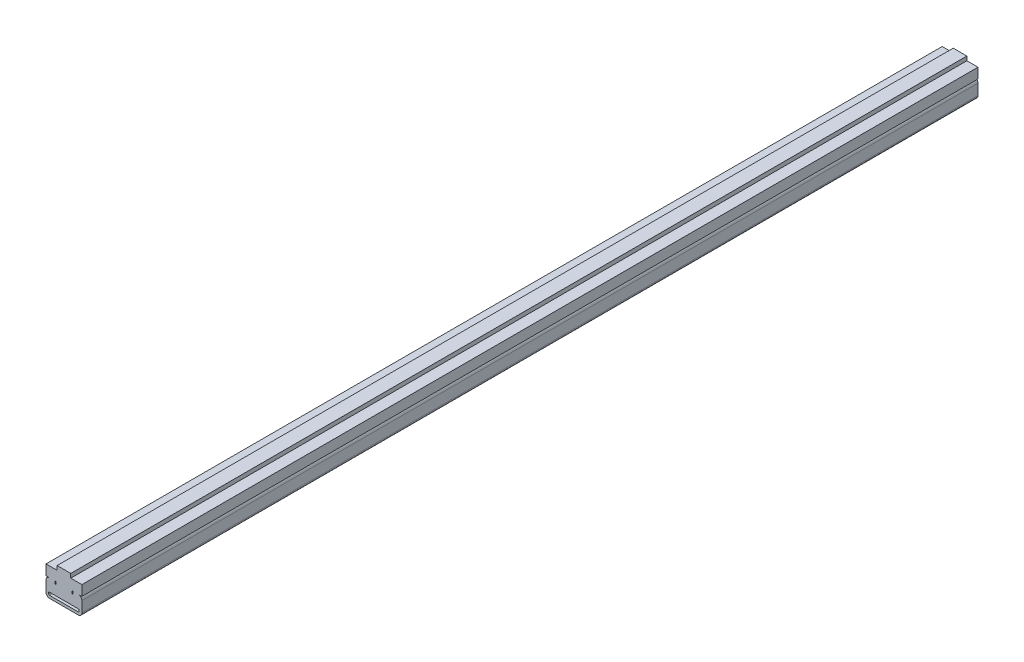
ISO-10303-21;
HEADER;
FILE_DESCRIPTION(('STEP AP214'),'2;1');
FILE_NAME('part.step','',(''),(''),'','','');
FILE_SCHEMA(('AUTOMOTIVE_DESIGN { 1 0 10303 214 1 1 1 1 }'));
ENDSEC;
DATA;
#1=APPLICATION_CONTEXT('core data for automotive mechanical design processes');
#2=APPLICATION_PROTOCOL_DEFINITION('international standard','automotive_design',2000,#1);
#3=PRODUCT_CONTEXT('',#1,'mechanical');
#4=PRODUCT('Part','Part','',(#3));
#5=PRODUCT_RELATED_PRODUCT_CATEGORY('part','',(#4));
#6=PRODUCT_DEFINITION_FORMATION('','',#4);
#7=PRODUCT_DEFINITION_CONTEXT('part definition',#1,'design');
#8=PRODUCT_DEFINITION('design','',#6,#7);
#9=PRODUCT_DEFINITION_SHAPE('','',#8);
#10=(LENGTH_UNIT() NAMED_UNIT(*) SI_UNIT(.MILLI.,.METRE.));
#11=(NAMED_UNIT(*) PLANE_ANGLE_UNIT() SI_UNIT($,.RADIAN.));
#12=(NAMED_UNIT(*) SI_UNIT($,.STERADIAN.) SOLID_ANGLE_UNIT());
#13=UNCERTAINTY_MEASURE_WITH_UNIT(LENGTH_MEASURE(1.E-05),#10,'distance_accuracy_value','');
#14=(GEOMETRIC_REPRESENTATION_CONTEXT(3) GLOBAL_UNCERTAINTY_ASSIGNED_CONTEXT((#13)) GLOBAL_UNIT_ASSIGNED_CONTEXT((#10,
#11,#12)) REPRESENTATION_CONTEXT('',''));
#15=CARTESIAN_POINT('',(0.,0.,0.));
#16=DIRECTION('',(0.,0.,1.));
#17=DIRECTION('',(1.,0.,0.));
#18=AXIS2_PLACEMENT_3D('',#15,#16,#17);
#19=CARTESIAN_POINT('',(8.,7.99999999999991,0.));
#20=DIRECTION('',(0.,0.,1.));
#21=DIRECTION('',(1.,0.,0.));
#22=AXIS2_PLACEMENT_3D('',#19,#20,#21);
#23=PLANE('',#22);
#24=DIRECTION('',(0.,-1.,0.));
#25=VECTOR('',#24,1.);
#26=CARTESIAN_POINT('',(-8.5,3.0000000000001,0.));
#27=LINE('',#26,#25);
#28=CARTESIAN_POINT('',(-8.5,3.0000000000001,0.));
#29=VERTEX_POINT('',#28);
#30=CARTESIAN_POINT('',(-8.5,1.9999999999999,0.));
#31=VERTEX_POINT('',#30);
#32=EDGE_CURVE('E224',#29,#31,#27,.T.);
#33=ORIENTED_EDGE('',*,*,#32,.T.);
#34=CARTESIAN_POINT('',(-8.,1.9999999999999,0.));
#35=DIRECTION('',(0.,0.,1.));
#36=DIRECTION('',(1.,0.,0.));
#37=AXIS2_PLACEMENT_3D('',#34,#35,#36);
#38=CIRCLE('',#37,0.5);
#39=CARTESIAN_POINT('',(-8.,1.4999999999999,0.));
#40=VERTEX_POINT('',#39);
#41=EDGE_CURVE('E219',#31,#40,#38,.T.);
#42=ORIENTED_EDGE('',*,*,#41,.T.);
#43=DIRECTION('',(-1.,0.,0.));
#44=VECTOR('',#43,1.);
#45=CARTESIAN_POINT('',(8.,1.5000000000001,0.));
#46=LINE('',#45,#44);
#47=CARTESIAN_POINT('',(8.,1.5000000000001,0.));
#48=VERTEX_POINT('',#47);
#49=EDGE_CURVE('E211',#48,#40,#46,.T.);
#50=ORIENTED_EDGE('',*,*,#49,.F.);
#51=CARTESIAN_POINT('',(8.,2.0000000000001,0.));
#52=DIRECTION('',(0.,0.,1.));
#53=DIRECTION('',(1.,0.,0.));
#54=AXIS2_PLACEMENT_3D('',#51,#52,#53);
#55=CIRCLE('',#54,0.5);
#56=CARTESIAN_POINT('',(8.5,2.0000000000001,0.));
#57=VERTEX_POINT('',#56);
#58=EDGE_CURVE('E29',#48,#57,#55,.T.);
#59=ORIENTED_EDGE('',*,*,#58,.T.);
#60=DIRECTION('',(0.,-1.,0.));
#61=VECTOR('',#60,1.);
#62=CARTESIAN_POINT('',(8.5,2.9999999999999,0.));
#63=LINE('',#62,#61);
#64=CARTESIAN_POINT('',(8.5,2.9999999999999,0.));
#65=VERTEX_POINT('',#64);
#66=EDGE_CURVE('E236',#65,#57,#63,.T.);
#67=ORIENTED_EDGE('',*,*,#66,.F.);
#68=DIRECTION('',(-1.,0.,0.));
#69=VECTOR('',#68,1.);
#70=CARTESIAN_POINT('',(8.5,2.9999999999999,0.));
#71=LINE('',#70,#69);
#72=EDGE_CURVE('E238',#65,#29,#71,.T.);
#73=ORIENTED_EDGE('',*,*,#72,.T.);
#74=EDGE_LOOP('',(#33,#42,#50,#59,#67,#73));
#75=FACE_BOUND('',#74,.T.);
#76=DIRECTION('',(-1.,0.,0.));
#77=VECTOR('',#76,1.);
#78=CARTESIAN_POINT('',(-8.,10.,0.));
#79=LINE('',#78,#77);
#80=CARTESIAN_POINT('',(-8.,10.,0.));
#81=VERTEX_POINT('',#80);
#82=CARTESIAN_POINT('',(-10.,10.,0.));
#83=VERTEX_POINT('',#82);
#84=EDGE_CURVE('E325',#81,#83,#79,.T.);
#85=ORIENTED_EDGE('',*,*,#84,.T.);
#86=DIRECTION('',(0.,-1.,0.));
#87=VECTOR('',#86,1.);
#88=CARTESIAN_POINT('',(-10.,15.7,0.));
#89=LINE('',#88,#87);
#90=CARTESIAN_POINT('',(-10.,15.7,0.));
#91=VERTEX_POINT('',#90);
#92=EDGE_CURVE('E327',#91,#83,#89,.T.);
#93=ORIENTED_EDGE('',*,*,#92,.F.);
#94=DIRECTION('',(-1.,0.,0.));
#95=VECTOR('',#94,1.);
#96=CARTESIAN_POINT('',(-3.79999999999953,15.7,0.));
#97=LINE('',#96,#95);
#98=CARTESIAN_POINT('',(-3.79999999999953,15.7,0.));
#99=VERTEX_POINT('',#98);
#100=EDGE_CURVE('E331',#99,#91,#97,.T.);
#101=ORIENTED_EDGE('',*,*,#100,.F.);
#102=DIRECTION('',(0.,-1.,0.));
#103=VECTOR('',#102,1.);
#104=CARTESIAN_POINT('',(-3.79999999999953,18.,0.));
#105=LINE('',#104,#103);
#106=CARTESIAN_POINT('',(-3.79999999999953,18.,0.));
#107=VERTEX_POINT('',#106);
#108=EDGE_CURVE('E334',#107,#99,#105,.T.);
#109=ORIENTED_EDGE('',*,*,#108,.F.);
#110=DIRECTION('',(-1.,0.,0.));
#111=VECTOR('',#110,1.);
#112=CARTESIAN_POINT('',(3.79999999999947,18.,0.));
#113=LINE('',#112,#111);
#114=CARTESIAN_POINT('',(3.79999999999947,18.,0.));
#115=VERTEX_POINT('',#114);
#116=EDGE_CURVE('E337',#115,#107,#113,.T.);
#117=ORIENTED_EDGE('',*,*,#116,.F.);
#118=DIRECTION('',(0.,-1.,0.));
#119=VECTOR('',#118,1.);
#120=CARTESIAN_POINT('',(3.79999999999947,18.,0.));
#121=LINE('',#120,#119);
#122=CARTESIAN_POINT('',(3.79999999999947,15.7,0.));
#123=VERTEX_POINT('',#122);
#124=EDGE_CURVE('E340',#115,#123,#121,.T.);
#125=ORIENTED_EDGE('',*,*,#124,.T.);
#126=DIRECTION('',(1.,0.,0.));
#127=VECTOR('',#126,1.);
#128=CARTESIAN_POINT('',(3.79999999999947,15.7,0.));
#129=LINE('',#128,#127);
#130=CARTESIAN_POINT('',(10.,15.7,0.));
#131=VERTEX_POINT('',#130);
#132=EDGE_CURVE('E342',#123,#131,#129,.T.);
#133=ORIENTED_EDGE('',*,*,#132,.T.);
#134=DIRECTION('',(0.,-1.,0.));
#135=VECTOR('',#134,1.);
#136=CARTESIAN_POINT('',(10.,15.7,0.));
#137=LINE('',#136,#135);
#138=CARTESIAN_POINT('',(10.,10.,0.));
#139=VERTEX_POINT('',#138);
#140=EDGE_CURVE('E344',#131,#139,#137,.T.);
#141=ORIENTED_EDGE('',*,*,#140,.T.);
#142=DIRECTION('',(-1.,0.,0.));
#143=VECTOR('',#142,1.);
#144=CARTESIAN_POINT('',(10.,10.,0.));
#145=LINE('',#144,#143);
#146=CARTESIAN_POINT('',(8.,10.,0.));
#147=VERTEX_POINT('',#146);
#148=EDGE_CURVE('E346',#139,#147,#145,.T.);
#149=ORIENTED_EDGE('',*,*,#148,.T.);
#150=CARTESIAN_POINT('',(8.,7.99999999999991,0.));
#151=DIRECTION('',(0.,0.,1.));
#152=DIRECTION('',(1.,0.,0.));
#153=AXIS2_PLACEMENT_3D('',#150,#151,#152);
#154=CIRCLE('',#153,2.);
#155=CARTESIAN_POINT('',(10.,7.99999999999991,0.));
#156=VERTEX_POINT('',#155);
#157=EDGE_CURVE('E348',#156,#147,#154,.T.);
#158=ORIENTED_EDGE('',*,*,#157,.F.);
#159=DIRECTION('',(0.,-1.,0.));
#160=VECTOR('',#159,1.);
#161=CARTESIAN_POINT('',(10.,7.99999999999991,0.));
#162=LINE('',#161,#160);
#163=CARTESIAN_POINT('',(10.,2.0000000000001,0.));
#164=VERTEX_POINT('',#163);
#165=EDGE_CURVE('E351',#156,#164,#162,.T.);
#166=ORIENTED_EDGE('',*,*,#165,.T.);
#167=CARTESIAN_POINT('',(8.,2.0000000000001,0.));
#168=DIRECTION('',(0.,0.,1.));
#169=DIRECTION('',(1.,0.,0.));
#170=AXIS2_PLACEMENT_3D('',#167,#168,#169);
#171=CIRCLE('',#170,2.);
#172=CARTESIAN_POINT('',(8.,0.,0.));
#173=VERTEX_POINT('',#172);
#174=EDGE_CURVE('E353',#173,#164,#171,.T.);
#175=ORIENTED_EDGE('',*,*,#174,.F.);
#176=DIRECTION('',(-1.,0.,0.));
#177=VECTOR('',#176,1.);
#178=CARTESIAN_POINT('',(8.,0.,0.));
#179=LINE('',#178,#177);
#180=CARTESIAN_POINT('',(-8.,0.,0.));
#181=VERTEX_POINT('',#180);
#182=EDGE_CURVE('E356',#173,#181,#179,.T.);
#183=ORIENTED_EDGE('',*,*,#182,.T.);
#184=CARTESIAN_POINT('',(-8.,1.9999999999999,0.));
#185=DIRECTION('',(0.,0.,1.));
#186=DIRECTION('',(1.,0.,0.));
#187=AXIS2_PLACEMENT_3D('',#184,#185,#186);
#188=CIRCLE('',#187,2.);
#189=CARTESIAN_POINT('',(-10.,1.9999999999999,0.));
#190=VERTEX_POINT('',#189);
#191=EDGE_CURVE('E358',#190,#181,#188,.T.);
#192=ORIENTED_EDGE('',*,*,#191,.F.);
#193=DIRECTION('',(0.,-1.,0.));
#194=VECTOR('',#193,1.);
#195=CARTESIAN_POINT('',(-10.,7.99999999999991,0.));
#196=LINE('',#195,#194);
#197=CARTESIAN_POINT('',(-10.,7.99999999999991,0.));
#198=VERTEX_POINT('',#197);
#199=EDGE_CURVE('E361',#198,#190,#196,.T.);
#200=ORIENTED_EDGE('',*,*,#199,.F.);
#201=CARTESIAN_POINT('',(-8.,7.99999999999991,0.));
#202=DIRECTION('',(0.,0.,1.));
#203=DIRECTION('',(1.,0.,0.));
#204=AXIS2_PLACEMENT_3D('',#201,#202,#203);
#205=CIRCLE('',#204,2.);
#206=EDGE_CURVE('E364',#81,#198,#205,.T.);
#207=ORIENTED_EDGE('',*,*,#206,.F.);
#208=EDGE_LOOP('',(#85,#93,#101,#109,#117,#125,#133,#141,#149,#158,#166,#175,#183,#192,#200,#207));
#209=FACE_BOUND('',#208,.T.);
#210=DIRECTION('',(-1.,0.,0.));
#211=VECTOR('',#210,1.);
#212=CARTESIAN_POINT('',(-4.5,8.49999999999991,0.));
#213=LINE('',#212,#211);
#214=CARTESIAN_POINT('',(-4.5,8.49999999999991,0.));
#215=VERTEX_POINT('',#214);
#216=CARTESIAN_POINT('',(-5.,8.50000000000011,0.));
#217=VERTEX_POINT('',#216);
#218=EDGE_CURVE('E304',#215,#217,#213,.T.);
#219=ORIENTED_EDGE('',*,*,#218,.F.);
#220=DIRECTION('',(0.,1.,0.));
#221=VECTOR('',#220,1.);
#222=CARTESIAN_POINT('',(-4.5,8.49999999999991,0.));
#223=LINE('',#222,#221);
#224=CARTESIAN_POINT('',(-4.5,10.,0.));
#225=VERTEX_POINT('',#224);
#226=EDGE_CURVE('E294',#215,#225,#223,.T.);
#227=ORIENTED_EDGE('',*,*,#226,.T.);
#228=DIRECTION('',(-1.,0.,0.));
#229=VECTOR('',#228,1.);
#230=CARTESIAN_POINT('',(-4.5,10.,0.));
#231=LINE('',#230,#229);
#232=CARTESIAN_POINT('',(-5.,10.,0.));
#233=VERTEX_POINT('',#232);
#234=EDGE_CURVE('E297',#225,#233,#231,.T.);
#235=ORIENTED_EDGE('',*,*,#234,.T.);
#236=DIRECTION('',(0.,1.,0.));
#237=VECTOR('',#236,1.);
#238=CARTESIAN_POINT('',(-5.,8.50000000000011,0.));
#239=LINE('',#238,#237);
#240=EDGE_CURVE('E301',#217,#233,#239,.T.);
#241=ORIENTED_EDGE('',*,*,#240,.F.);
#242=EDGE_LOOP('',(#219,#227,#235,#241));
#243=FACE_BOUND('',#242,.T.);
#244=DIRECTION('',(-1.,0.,0.));
#245=VECTOR('',#244,1.);
#246=CARTESIAN_POINT('',(5.,8.50000000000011,0.));
#247=LINE('',#246,#245);
#248=CARTESIAN_POINT('',(5.,8.50000000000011,0.));
#249=VERTEX_POINT('',#248);
#250=CARTESIAN_POINT('',(4.5,8.50000000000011,0.));
#251=VERTEX_POINT('',#250);
#252=EDGE_CURVE('E262',#249,#251,#247,.T.);
#253=ORIENTED_EDGE('',*,*,#252,.F.);
#254=DIRECTION('',(0.,1.,0.));
#255=VECTOR('',#254,1.);
#256=CARTESIAN_POINT('',(5.,8.50000000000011,0.));
#257=LINE('',#256,#255);
#258=CARTESIAN_POINT('',(5.,10.,0.));
#259=VERTEX_POINT('',#258);
#260=EDGE_CURVE('E270',#249,#259,#257,.T.);
#261=ORIENTED_EDGE('',*,*,#260,.T.);
#262=DIRECTION('',(-1.,0.,0.));
#263=VECTOR('',#262,1.);
#264=CARTESIAN_POINT('',(5.,10.,0.));
#265=LINE('',#264,#263);
#266=CARTESIAN_POINT('',(4.5,10.,0.));
#267=VERTEX_POINT('',#266);
#268=EDGE_CURVE('E267',#259,#267,#265,.T.);
#269=ORIENTED_EDGE('',*,*,#268,.T.);
#270=DIRECTION('',(0.,1.,0.));
#271=VECTOR('',#270,1.);
#272=CARTESIAN_POINT('',(4.5,8.50000000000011,0.));
#273=LINE('',#272,#271);
#274=EDGE_CURVE('E264',#251,#267,#273,.T.);
#275=ORIENTED_EDGE('',*,*,#274,.F.);
#276=EDGE_LOOP('',(#253,#261,#269,#275));
#277=FACE_BOUND('',#276,.T.);
#278=ADVANCED_FACE('F14',(#75,#209,#243,#277),#23,.F.);
#279=CARTESIAN_POINT('',(8.,7.99999999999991,500.));
#280=DIRECTION('',(0.,0.,1.));
#281=DIRECTION('',(1.,0.,0.));
#282=AXIS2_PLACEMENT_3D('',#279,#280,#281);
#283=PLANE('',#282);
#284=CARTESIAN_POINT('',(-8.,1.9999999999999,500.));
#285=DIRECTION('',(0.,0.,1.));
#286=DIRECTION('',(1.,0.,0.));
#287=AXIS2_PLACEMENT_3D('',#284,#285,#286);
#288=CIRCLE('',#287,0.5);
#289=CARTESIAN_POINT('',(-8.5,1.9999999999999,500.));
#290=VERTEX_POINT('',#289);
#291=CARTESIAN_POINT('',(-8.,1.4999999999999,500.));
#292=VERTEX_POINT('',#291);
#293=EDGE_CURVE('E37',#290,#292,#288,.T.);
#294=ORIENTED_EDGE('',*,*,#293,.F.);
#295=DIRECTION('',(0.,-1.,0.));
#296=VECTOR('',#295,1.);
#297=CARTESIAN_POINT('',(-8.5,3.0000000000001,500.));
#298=LINE('',#297,#296);
#299=CARTESIAN_POINT('',(-8.5,3.0000000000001,500.));
#300=VERTEX_POINT('',#299);
#301=EDGE_CURVE('E229',#300,#290,#298,.T.);
#302=ORIENTED_EDGE('',*,*,#301,.F.);
#303=DIRECTION('',(-1.,0.,0.));
#304=VECTOR('',#303,1.);
#305=CARTESIAN_POINT('',(8.5,2.9999999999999,500.));
#306=LINE('',#305,#304);
#307=CARTESIAN_POINT('',(8.5,2.9999999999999,500.));
#308=VERTEX_POINT('',#307);
#309=EDGE_CURVE('E232',#308,#300,#306,.T.);
#310=ORIENTED_EDGE('',*,*,#309,.F.);
#311=DIRECTION('',(0.,-1.,0.));
#312=VECTOR('',#311,1.);
#313=CARTESIAN_POINT('',(8.5,2.9999999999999,500.));
#314=LINE('',#313,#312);
#315=CARTESIAN_POINT('',(8.5,2.0000000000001,500.));
#316=VERTEX_POINT('',#315);
#317=EDGE_CURVE('E247',#308,#316,#314,.T.);
#318=ORIENTED_EDGE('',*,*,#317,.T.);
#319=CARTESIAN_POINT('',(8.,2.0000000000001,500.));
#320=DIRECTION('',(0.,0.,1.));
#321=DIRECTION('',(1.,0.,0.));
#322=AXIS2_PLACEMENT_3D('',#319,#320,#321);
#323=CIRCLE('',#322,0.5);
#324=CARTESIAN_POINT('',(8.,1.5000000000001,500.));
#325=VERTEX_POINT('',#324);
#326=EDGE_CURVE('E244',#325,#316,#323,.T.);
#327=ORIENTED_EDGE('',*,*,#326,.F.);
#328=DIRECTION('',(-1.,0.,0.));
#329=VECTOR('',#328,1.);
#330=CARTESIAN_POINT('',(8.,1.5000000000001,500.));
#331=LINE('',#330,#329);
#332=EDGE_CURVE('E242',#325,#292,#331,.T.);
#333=ORIENTED_EDGE('',*,*,#332,.T.);
#334=EDGE_LOOP('',(#294,#302,#310,#318,#327,#333));
#335=FACE_BOUND('',#334,.T.);
#336=DIRECTION('',(-1.,0.,0.));
#337=VECTOR('',#336,1.);
#338=CARTESIAN_POINT('',(-8.,10.,500.));
#339=LINE('',#338,#337);
#340=CARTESIAN_POINT('',(-8.,10.,500.));
#341=VERTEX_POINT('',#340);
#342=CARTESIAN_POINT('',(-10.,10.,500.));
#343=VERTEX_POINT('',#342);
#344=EDGE_CURVE('E318',#341,#343,#339,.T.);
#345=ORIENTED_EDGE('',*,*,#344,.F.);
#346=CARTESIAN_POINT('',(-8.,7.99999999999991,500.));
#347=DIRECTION('',(0.,0.,1.));
#348=DIRECTION('',(1.,0.,0.));
#349=AXIS2_PLACEMENT_3D('',#346,#347,#348);
#350=CIRCLE('',#349,2.);
#351=CARTESIAN_POINT('',(-10.,7.99999999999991,500.));
#352=VERTEX_POINT('',#351);
#353=EDGE_CURVE('E328',#341,#352,#350,.T.);
#354=ORIENTED_EDGE('',*,*,#353,.T.);
#355=DIRECTION('',(0.,-1.,0.));
#356=VECTOR('',#355,1.);
#357=CARTESIAN_POINT('',(-10.,7.99999999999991,500.));
#358=LINE('',#357,#356);
#359=CARTESIAN_POINT('',(-10.,1.9999999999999,500.));
#360=VERTEX_POINT('',#359);
#361=EDGE_CURVE('E406',#352,#360,#358,.T.);
#362=ORIENTED_EDGE('',*,*,#361,.T.);
#363=CARTESIAN_POINT('',(-8.,1.9999999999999,500.));
#364=DIRECTION('',(0.,0.,1.));
#365=DIRECTION('',(1.,0.,0.));
#366=AXIS2_PLACEMENT_3D('',#363,#364,#365);
#367=CIRCLE('',#366,2.);
#368=CARTESIAN_POINT('',(-8.,0.,500.));
#369=VERTEX_POINT('',#368);
#370=EDGE_CURVE('E403',#360,#369,#367,.T.);
#371=ORIENTED_EDGE('',*,*,#370,.T.);
#372=DIRECTION('',(-1.,0.,0.));
#373=VECTOR('',#372,1.);
#374=CARTESIAN_POINT('',(8.,0.,500.));
#375=LINE('',#374,#373);
#376=CARTESIAN_POINT('',(8.,0.,500.));
#377=VERTEX_POINT('',#376);
#378=EDGE_CURVE('E400',#377,#369,#375,.T.);
#379=ORIENTED_EDGE('',*,*,#378,.F.);
#380=CARTESIAN_POINT('',(8.,2.0000000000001,500.));
#381=DIRECTION('',(0.,0.,1.));
#382=DIRECTION('',(1.,0.,0.));
#383=AXIS2_PLACEMENT_3D('',#380,#381,#382);
#384=CIRCLE('',#383,2.);
#385=CARTESIAN_POINT('',(10.,2.0000000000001,500.));
#386=VERTEX_POINT('',#385);
#387=EDGE_CURVE('E397',#377,#386,#384,.T.);
#388=ORIENTED_EDGE('',*,*,#387,.T.);
#389=DIRECTION('',(0.,-1.,0.));
#390=VECTOR('',#389,1.);
#391=CARTESIAN_POINT('',(10.,7.99999999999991,500.));
#392=LINE('',#391,#390);
#393=CARTESIAN_POINT('',(10.,7.99999999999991,500.));
#394=VERTEX_POINT('',#393);
#395=EDGE_CURVE('E394',#394,#386,#392,.T.);
#396=ORIENTED_EDGE('',*,*,#395,.F.);
#397=CARTESIAN_POINT('',(8.,7.99999999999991,500.));
#398=DIRECTION('',(0.,0.,1.));
#399=DIRECTION('',(1.,0.,0.));
#400=AXIS2_PLACEMENT_3D('',#397,#398,#399);
#401=CIRCLE('',#400,2.);
#402=CARTESIAN_POINT('',(8.,10.,500.));
#403=VERTEX_POINT('',#402);
#404=EDGE_CURVE('E391',#394,#403,#401,.T.);
#405=ORIENTED_EDGE('',*,*,#404,.T.);
#406=DIRECTION('',(-1.,0.,0.));
#407=VECTOR('',#406,1.);
#408=CARTESIAN_POINT('',(10.,10.,500.));
#409=LINE('',#408,#407);
#410=CARTESIAN_POINT('',(10.,10.,500.));
#411=VERTEX_POINT('',#410);
#412=EDGE_CURVE('E388',#411,#403,#409,.T.);
#413=ORIENTED_EDGE('',*,*,#412,.F.);
#414=DIRECTION('',(0.,-1.,0.));
#415=VECTOR('',#414,1.);
#416=CARTESIAN_POINT('',(10.,15.7,500.));
#417=LINE('',#416,#415);
#418=CARTESIAN_POINT('',(10.,15.7,500.));
#419=VERTEX_POINT('',#418);
#420=EDGE_CURVE('E386',#419,#411,#417,.T.);
#421=ORIENTED_EDGE('',*,*,#420,.F.);
#422=DIRECTION('',(1.,0.,0.));
#423=VECTOR('',#422,1.);
#424=CARTESIAN_POINT('',(3.79999999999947,15.7,500.));
#425=LINE('',#424,#423);
#426=CARTESIAN_POINT('',(3.79999999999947,15.7,500.));
#427=VERTEX_POINT('',#426);
#428=EDGE_CURVE('E384',#427,#419,#425,.T.);
#429=ORIENTED_EDGE('',*,*,#428,.F.);
#430=DIRECTION('',(0.,-1.,0.));
#431=VECTOR('',#430,1.);
#432=CARTESIAN_POINT('',(3.79999999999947,18.,500.));
#433=LINE('',#432,#431);
#434=CARTESIAN_POINT('',(3.79999999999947,18.,500.));
#435=VERTEX_POINT('',#434);
#436=EDGE_CURVE('E382',#435,#427,#433,.T.);
#437=ORIENTED_EDGE('',*,*,#436,.F.);
#438=DIRECTION('',(-1.,0.,0.));
#439=VECTOR('',#438,1.);
#440=CARTESIAN_POINT('',(3.79999999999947,18.,500.));
#441=LINE('',#440,#439);
#442=CARTESIAN_POINT('',(-3.79999999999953,18.,500.));
#443=VERTEX_POINT('',#442);
#444=EDGE_CURVE('E379',#435,#443,#441,.T.);
#445=ORIENTED_EDGE('',*,*,#444,.T.);
#446=DIRECTION('',(0.,-1.,0.));
#447=VECTOR('',#446,1.);
#448=CARTESIAN_POINT('',(-3.79999999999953,18.,500.));
#449=LINE('',#448,#447);
#450=CARTESIAN_POINT('',(-3.79999999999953,15.7,500.));
#451=VERTEX_POINT('',#450);
#452=EDGE_CURVE('E376',#443,#451,#449,.T.);
#453=ORIENTED_EDGE('',*,*,#452,.T.);
#454=DIRECTION('',(-1.,0.,0.));
#455=VECTOR('',#454,1.);
#456=CARTESIAN_POINT('',(-3.79999999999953,15.7,500.));
#457=LINE('',#456,#455);
#458=CARTESIAN_POINT('',(-10.,15.7,500.));
#459=VERTEX_POINT('',#458);
#460=EDGE_CURVE('E373',#451,#459,#457,.T.);
#461=ORIENTED_EDGE('',*,*,#460,.T.);
#462=DIRECTION('',(0.,-1.,0.));
#463=VECTOR('',#462,1.);
#464=CARTESIAN_POINT('',(-10.,15.7,500.));
#465=LINE('',#464,#463);
#466=EDGE_CURVE('E370',#459,#343,#465,.T.);
#467=ORIENTED_EDGE('',*,*,#466,.T.);
#468=EDGE_LOOP('',(#345,#354,#362,#371,#379,#388,#396,#405,#413,#421,#429,#437,#445,#453,#461,#467));
#469=FACE_BOUND('',#468,.T.);
#470=DIRECTION('',(0.,1.,0.));
#471=VECTOR('',#470,1.);
#472=CARTESIAN_POINT('',(-4.5,8.49999999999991,500.));
#473=LINE('',#472,#471);
#474=CARTESIAN_POINT('',(-4.5,8.49999999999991,500.));
#475=VERTEX_POINT('',#474);
#476=CARTESIAN_POINT('',(-4.5,10.,500.));
#477=VERTEX_POINT('',#476);
#478=EDGE_CURVE('E293',#475,#477,#473,.T.);
#479=ORIENTED_EDGE('',*,*,#478,.F.);
#480=DIRECTION('',(-1.,0.,0.));
#481=VECTOR('',#480,1.);
#482=CARTESIAN_POINT('',(-4.5,8.49999999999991,500.));
#483=LINE('',#482,#481);
#484=CARTESIAN_POINT('',(-5.,8.50000000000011,500.));
#485=VERTEX_POINT('',#484);
#486=EDGE_CURVE('E298',#475,#485,#483,.T.);
#487=ORIENTED_EDGE('',*,*,#486,.T.);
#488=DIRECTION('',(0.,1.,0.));
#489=VECTOR('',#488,1.);
#490=CARTESIAN_POINT('',(-5.,8.50000000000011,500.));
#491=LINE('',#490,#489);
#492=CARTESIAN_POINT('',(-5.,10.,500.));
#493=VERTEX_POINT('',#492);
#494=EDGE_CURVE('E311',#485,#493,#491,.T.);
#495=ORIENTED_EDGE('',*,*,#494,.T.);
#496=DIRECTION('',(-1.,0.,0.));
#497=VECTOR('',#496,1.);
#498=CARTESIAN_POINT('',(-4.5,10.,500.));
#499=LINE('',#498,#497);
#500=EDGE_CURVE('E308',#477,#493,#499,.T.);
#501=ORIENTED_EDGE('',*,*,#500,.F.);
#502=EDGE_LOOP('',(#479,#487,#495,#501));
#503=FACE_BOUND('',#502,.T.);
#504=DIRECTION('',(0.,1.,0.));
#505=VECTOR('',#504,1.);
#506=CARTESIAN_POINT('',(5.,8.50000000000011,500.));
#507=LINE('',#506,#505);
#508=CARTESIAN_POINT('',(5.,8.50000000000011,500.));
#509=VERTEX_POINT('',#508);
#510=CARTESIAN_POINT('',(5.,10.,500.));
#511=VERTEX_POINT('',#510);
#512=EDGE_CURVE('E265',#509,#511,#507,.T.);
#513=ORIENTED_EDGE('',*,*,#512,.F.);
#514=DIRECTION('',(-1.,0.,0.));
#515=VECTOR('',#514,1.);
#516=CARTESIAN_POINT('',(5.,8.50000000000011,500.));
#517=LINE('',#516,#515);
#518=CARTESIAN_POINT('',(4.5,8.50000000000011,500.));
#519=VERTEX_POINT('',#518);
#520=EDGE_CURVE('E254',#509,#519,#517,.T.);
#521=ORIENTED_EDGE('',*,*,#520,.T.);
#522=DIRECTION('',(0.,1.,0.));
#523=VECTOR('',#522,1.);
#524=CARTESIAN_POINT('',(4.5,8.50000000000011,500.));
#525=LINE('',#524,#523);
#526=CARTESIAN_POINT('',(4.5,10.,500.));
#527=VERTEX_POINT('',#526);
#528=EDGE_CURVE('E276',#519,#527,#525,.T.);
#529=ORIENTED_EDGE('',*,*,#528,.T.);
#530=DIRECTION('',(-1.,0.,0.));
#531=VECTOR('',#530,1.);
#532=CARTESIAN_POINT('',(5.,10.,500.));
#533=LINE('',#532,#531);
#534=EDGE_CURVE('E279',#511,#527,#533,.T.);
#535=ORIENTED_EDGE('',*,*,#534,.F.);
#536=EDGE_LOOP('',(#513,#521,#529,#535));
#537=FACE_BOUND('',#536,.T.);
#538=ADVANCED_FACE('F451',(#335,#469,#503,#537),#283,.T.);
#539=CARTESIAN_POINT('',(-8.,10.,0.));
#540=DIRECTION('',(0.,1.,0.));
#541=DIRECTION('',(-1.,0.,0.));
#542=AXIS2_PLACEMENT_3D('',#539,#540,#541);
#543=PLANE('',#542);
#544=ORIENTED_EDGE('',*,*,#344,.T.);
#545=DIRECTION('',(0.,0.,1.));
#546=VECTOR('',#545,1.);
#547=CARTESIAN_POINT('',(-10.,10.,0.));
#548=LINE('',#547,#546);
#549=EDGE_CURVE('E9',#83,#343,#548,.T.);
#550=ORIENTED_EDGE('',*,*,#549,.F.);
#551=ORIENTED_EDGE('',*,*,#84,.F.);
#552=DIRECTION('',(0.,0.,1.));
#553=VECTOR('',#552,1.);
#554=CARTESIAN_POINT('',(-8.,10.,0.));
#555=LINE('',#554,#553);
#556=EDGE_CURVE('E367',#81,#341,#555,.T.);
#557=ORIENTED_EDGE('',*,*,#556,.T.);
#558=EDGE_LOOP('',(#544,#550,#551,#557));
#559=FACE_BOUND('',#558,.T.);
#560=ADVANCED_FACE('F16',(#559),#543,.F.);
#561=CARTESIAN_POINT('',(-10.,15.7,0.));
#562=DIRECTION('',(-1.,0.,0.));
#563=DIRECTION('',(0.,-1.,0.));
#564=AXIS2_PLACEMENT_3D('',#561,#562,#563);
#565=PLANE('',#564);
#566=ORIENTED_EDGE('',*,*,#466,.F.);
#567=DIRECTION('',(0.,0.,1.));
#568=VECTOR('',#567,1.);
#569=CARTESIAN_POINT('',(-10.,15.7,0.));
#570=LINE('',#569,#568);
#571=EDGE_CURVE('E22',#91,#459,#570,.T.);
#572=ORIENTED_EDGE('',*,*,#571,.F.);
#573=ORIENTED_EDGE('',*,*,#92,.T.);
#574=ORIENTED_EDGE('',*,*,#549,.T.);
#575=EDGE_LOOP('',(#566,#572,#573,#574));
#576=FACE_BOUND('',#575,.T.);
#577=ADVANCED_FACE('F447',(#576),#565,.T.);
#578=CARTESIAN_POINT('',(-3.79999999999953,15.7,0.));
#579=DIRECTION('',(0.,1.,0.));
#580=DIRECTION('',(0.,0.,1.));
#581=AXIS2_PLACEMENT_3D('',#578,#579,#580);
#582=PLANE('',#581);
#583=ORIENTED_EDGE('',*,*,#460,.F.);
#584=DIRECTION('',(0.,0.,1.));
#585=VECTOR('',#584,1.);
#586=CARTESIAN_POINT('',(-3.79999999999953,15.7,0.));
#587=LINE('',#586,#585);
#588=EDGE_CURVE('E439',#99,#451,#587,.T.);
#589=ORIENTED_EDGE('',*,*,#588,.F.);
#590=ORIENTED_EDGE('',*,*,#100,.T.);
#591=ORIENTED_EDGE('',*,*,#571,.T.);
#592=EDGE_LOOP('',(#583,#589,#590,#591));
#593=FACE_BOUND('',#592,.T.);
#594=ADVANCED_FACE('F443',(#593),#582,.T.);
#595=CARTESIAN_POINT('',(-3.79999999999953,18.,0.));
#596=DIRECTION('',(-1.,0.,0.));
#597=DIRECTION('',(0.,-1.,0.));
#598=AXIS2_PLACEMENT_3D('',#595,#596,#597);
#599=PLANE('',#598);
#600=ORIENTED_EDGE('',*,*,#452,.F.);
#601=DIRECTION('',(0.,0.,1.));
#602=VECTOR('',#601,1.);
#603=CARTESIAN_POINT('',(-3.79999999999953,18.,0.));
#604=LINE('',#603,#602);
#605=EDGE_CURVE('E437',#107,#443,#604,.T.);
#606=ORIENTED_EDGE('',*,*,#605,.F.);
#607=ORIENTED_EDGE('',*,*,#108,.T.);
#608=ORIENTED_EDGE('',*,*,#588,.T.);
#609=EDGE_LOOP('',(#600,#606,#607,#608));
#610=FACE_BOUND('',#609,.T.);
#611=ADVANCED_FACE('F457',(#610),#599,.T.);
#612=CARTESIAN_POINT('',(3.79999999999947,18.,0.));
#613=DIRECTION('',(0.,1.,0.));
#614=DIRECTION('',(0.,0.,1.));
#615=AXIS2_PLACEMENT_3D('',#612,#613,#614);
#616=PLANE('',#615);
#617=ORIENTED_EDGE('',*,*,#444,.F.);
#618=DIRECTION('',(0.,0.,1.));
#619=VECTOR('',#618,1.);
#620=CARTESIAN_POINT('',(3.79999999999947,18.,0.));
#621=LINE('',#620,#619);
#622=EDGE_CURVE('E435',#115,#435,#621,.T.);
#623=ORIENTED_EDGE('',*,*,#622,.F.);
#624=ORIENTED_EDGE('',*,*,#116,.T.);
#625=ORIENTED_EDGE('',*,*,#605,.T.);
#626=EDGE_LOOP('',(#617,#623,#624,#625));
#627=FACE_BOUND('',#626,.T.);
#628=ADVANCED_FACE('F512',(#627),#616,.T.);
#629=CARTESIAN_POINT('',(3.79999999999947,18.,0.));
#630=DIRECTION('',(-1.,0.,0.));
#631=DIRECTION('',(0.,-1.,0.));
#632=AXIS2_PLACEMENT_3D('',#629,#630,#631);
#633=PLANE('',#632);
#634=ORIENTED_EDGE('',*,*,#436,.T.);
#635=DIRECTION('',(0.,0.,1.));
#636=VECTOR('',#635,1.);
#637=CARTESIAN_POINT('',(3.79999999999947,15.7,0.));
#638=LINE('',#637,#636);
#639=EDGE_CURVE('E432',#123,#427,#638,.T.);
#640=ORIENTED_EDGE('',*,*,#639,.F.);
#641=ORIENTED_EDGE('',*,*,#124,.F.);
#642=ORIENTED_EDGE('',*,*,#622,.T.);
#643=EDGE_LOOP('',(#634,#640,#641,#642));
#644=FACE_BOUND('',#643,.T.);
#645=ADVANCED_FACE('F510',(#644),#633,.F.);
#646=CARTESIAN_POINT('',(3.79999999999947,15.7,0.));
#647=DIRECTION('',(0.,-1.,0.));
#648=DIRECTION('',(0.,0.,-1.));
#649=AXIS2_PLACEMENT_3D('',#646,#647,#648);
#650=PLANE('',#649);
#651=ORIENTED_EDGE('',*,*,#428,.T.);
#652=DIRECTION('',(0.,0.,1.));
#653=VECTOR('',#652,1.);
#654=CARTESIAN_POINT('',(10.,15.7,0.));
#655=LINE('',#654,#653);
#656=EDGE_CURVE('E429',#131,#419,#655,.T.);
#657=ORIENTED_EDGE('',*,*,#656,.F.);
#658=ORIENTED_EDGE('',*,*,#132,.F.);
#659=ORIENTED_EDGE('',*,*,#639,.T.);
#660=EDGE_LOOP('',(#651,#657,#658,#659));
#661=FACE_BOUND('',#660,.T.);
#662=ADVANCED_FACE('F506',(#661),#650,.F.);
#663=CARTESIAN_POINT('',(10.,15.7,0.));
#664=DIRECTION('',(-1.,0.,0.));
#665=DIRECTION('',(0.,0.,1.));
#666=AXIS2_PLACEMENT_3D('',#663,#664,#665);
#667=PLANE('',#666);
#668=ORIENTED_EDGE('',*,*,#420,.T.);
#669=DIRECTION('',(0.,0.,1.));
#670=VECTOR('',#669,1.);
#671=CARTESIAN_POINT('',(10.,10.,0.));
#672=LINE('',#671,#670);
#673=EDGE_CURVE('E426',#139,#411,#672,.T.);
#674=ORIENTED_EDGE('',*,*,#673,.F.);
#675=ORIENTED_EDGE('',*,*,#140,.F.);
#676=ORIENTED_EDGE('',*,*,#656,.T.);
#677=EDGE_LOOP('',(#668,#674,#675,#676));
#678=FACE_BOUND('',#677,.T.);
#679=ADVANCED_FACE('F501',(#678),#667,.F.);
#680=CARTESIAN_POINT('',(10.,10.,0.));
#681=DIRECTION('',(0.,1.,0.));
#682=DIRECTION('',(-1.,0.,0.));
#683=AXIS2_PLACEMENT_3D('',#680,#681,#682);
#684=PLANE('',#683);
#685=ORIENTED_EDGE('',*,*,#412,.T.);
#686=DIRECTION('',(0.,0.,1.));
#687=VECTOR('',#686,1.);
#688=CARTESIAN_POINT('',(8.,10.,0.));
#689=LINE('',#688,#687);
#690=EDGE_CURVE('E424',#147,#403,#689,.T.);
#691=ORIENTED_EDGE('',*,*,#690,.F.);
#692=ORIENTED_EDGE('',*,*,#148,.F.);
#693=ORIENTED_EDGE('',*,*,#673,.T.);
#694=EDGE_LOOP('',(#685,#691,#692,#693));
#695=FACE_BOUND('',#694,.T.);
#696=ADVANCED_FACE('F496',(#695),#684,.F.);
#697=CARTESIAN_POINT('',(8.,7.99999999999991,0.));
#698=DIRECTION('',(0.,0.,1.));
#699=DIRECTION('',(1.,0.,0.));
#700=AXIS2_PLACEMENT_3D('',#697,#698,#699);
#701=CYLINDRICAL_SURFACE('',#700,2.);
#702=ORIENTED_EDGE('',*,*,#404,.F.);
#703=DIRECTION('',(0.,0.,1.));
#704=VECTOR('',#703,1.);
#705=CARTESIAN_POINT('',(10.,7.99999999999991,0.));
#706=LINE('',#705,#704);
#707=EDGE_CURVE('E422',#156,#394,#706,.T.);
#708=ORIENTED_EDGE('',*,*,#707,.F.);
#709=ORIENTED_EDGE('',*,*,#157,.T.);
#710=ORIENTED_EDGE('',*,*,#690,.T.);
#711=EDGE_LOOP('',(#702,#708,#709,#710));
#712=FACE_BOUND('',#711,.T.);
#713=ADVANCED_FACE('F490',(#712),#701,.T.);
#714=CARTESIAN_POINT('',(10.,7.99999999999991,0.));
#715=DIRECTION('',(-1.,0.,0.));
#716=DIRECTION('',(0.,0.,1.));
#717=AXIS2_PLACEMENT_3D('',#714,#715,#716);
#718=PLANE('',#717);
#719=ORIENTED_EDGE('',*,*,#395,.T.);
#720=DIRECTION('',(0.,0.,1.));
#721=VECTOR('',#720,1.);
#722=CARTESIAN_POINT('',(10.,2.0000000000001,0.));
#723=LINE('',#722,#721);
#724=EDGE_CURVE('E420',#164,#386,#723,.T.);
#725=ORIENTED_EDGE('',*,*,#724,.F.);
#726=ORIENTED_EDGE('',*,*,#165,.F.);
#727=ORIENTED_EDGE('',*,*,#707,.T.);
#728=EDGE_LOOP('',(#719,#725,#726,#727));
#729=FACE_BOUND('',#728,.T.);
#730=ADVANCED_FACE('F513',(#729),#718,.F.);
#731=CARTESIAN_POINT('',(8.,2.0000000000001,0.));
#732=DIRECTION('',(0.,0.,1.));
#733=DIRECTION('',(1.,0.,0.));
#734=AXIS2_PLACEMENT_3D('',#731,#732,#733);
#735=CYLINDRICAL_SURFACE('',#734,2.);
#736=ORIENTED_EDGE('',*,*,#387,.F.);
#737=DIRECTION('',(0.,0.,1.));
#738=VECTOR('',#737,1.);
#739=CARTESIAN_POINT('',(8.,0.,0.));
#740=LINE('',#739,#738);
#741=EDGE_CURVE('E418',#173,#377,#740,.T.);
#742=ORIENTED_EDGE('',*,*,#741,.F.);
#743=ORIENTED_EDGE('',*,*,#174,.T.);
#744=ORIENTED_EDGE('',*,*,#724,.T.);
#745=EDGE_LOOP('',(#736,#742,#743,#744));
#746=FACE_BOUND('',#745,.T.);
#747=ADVANCED_FACE('F483',(#746),#735,.T.);
#748=CARTESIAN_POINT('',(8.,0.,0.));
#749=DIRECTION('',(0.,1.,0.));
#750=DIRECTION('',(-1.,0.,0.));
#751=AXIS2_PLACEMENT_3D('',#748,#749,#750);
#752=PLANE('',#751);
#753=ORIENTED_EDGE('',*,*,#378,.T.);
#754=DIRECTION('',(0.,0.,1.));
#755=VECTOR('',#754,1.);
#756=CARTESIAN_POINT('',(-8.,0.,0.));
#757=LINE('',#756,#755);
#758=EDGE_CURVE('E416',#181,#369,#757,.T.);
#759=ORIENTED_EDGE('',*,*,#758,.F.);
#760=ORIENTED_EDGE('',*,*,#182,.F.);
#761=ORIENTED_EDGE('',*,*,#741,.T.);
#762=EDGE_LOOP('',(#753,#759,#760,#761));
#763=FACE_BOUND('',#762,.T.);
#764=ADVANCED_FACE('F480',(#763),#752,.F.);
#765=CARTESIAN_POINT('',(-8.,1.9999999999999,0.));
#766=DIRECTION('',(0.,0.,1.));
#767=DIRECTION('',(1.,0.,0.));
#768=AXIS2_PLACEMENT_3D('',#765,#766,#767);
#769=CYLINDRICAL_SURFACE('',#768,2.);
#770=ORIENTED_EDGE('',*,*,#370,.F.);
#771=DIRECTION('',(0.,0.,1.));
#772=VECTOR('',#771,1.);
#773=CARTESIAN_POINT('',(-10.,1.9999999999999,0.));
#774=LINE('',#773,#772);
#775=EDGE_CURVE('E414',#190,#360,#774,.T.);
#776=ORIENTED_EDGE('',*,*,#775,.F.);
#777=ORIENTED_EDGE('',*,*,#191,.T.);
#778=ORIENTED_EDGE('',*,*,#758,.T.);
#779=EDGE_LOOP('',(#770,#776,#777,#778));
#780=FACE_BOUND('',#779,.T.);
#781=ADVANCED_FACE('F475',(#780),#769,.T.);
#782=CARTESIAN_POINT('',(-10.,7.99999999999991,0.));
#783=DIRECTION('',(-1.,0.,0.));
#784=DIRECTION('',(0.,0.,1.));
#785=AXIS2_PLACEMENT_3D('',#782,#783,#784);
#786=PLANE('',#785);
#787=ORIENTED_EDGE('',*,*,#361,.F.);
#788=DIRECTION('',(0.,0.,1.));
#789=VECTOR('',#788,1.);
#790=CARTESIAN_POINT('',(-10.,7.99999999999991,0.));
#791=LINE('',#790,#789);
#792=EDGE_CURVE('E412',#198,#352,#791,.T.);
#793=ORIENTED_EDGE('',*,*,#792,.F.);
#794=ORIENTED_EDGE('',*,*,#199,.T.);
#795=ORIENTED_EDGE('',*,*,#775,.T.);
#796=EDGE_LOOP('',(#787,#793,#794,#795));
#797=FACE_BOUND('',#796,.T.);
#798=ADVANCED_FACE('F470',(#797),#786,.T.);
#799=CARTESIAN_POINT('',(-8.,7.99999999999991,0.));
#800=DIRECTION('',(0.,0.,1.));
#801=DIRECTION('',(1.,0.,0.));
#802=AXIS2_PLACEMENT_3D('',#799,#800,#801);
#803=CYLINDRICAL_SURFACE('',#802,2.);
#804=ORIENTED_EDGE('',*,*,#353,.F.);
#805=ORIENTED_EDGE('',*,*,#556,.F.);
#806=ORIENTED_EDGE('',*,*,#206,.T.);
#807=ORIENTED_EDGE('',*,*,#792,.T.);
#808=EDGE_LOOP('',(#804,#805,#806,#807));
#809=FACE_BOUND('',#808,.T.);
#810=ADVANCED_FACE('F467',(#809),#803,.T.);
#811=CARTESIAN_POINT('',(-4.5,8.49999999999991,0.));
#812=DIRECTION('',(1.,0.,0.));
#813=DIRECTION('',(0.,0.,-1.));
#814=AXIS2_PLACEMENT_3D('',#811,#812,#813);
#815=PLANE('',#814);
#816=ORIENTED_EDGE('',*,*,#478,.T.);
#817=DIRECTION('',(0.,0.,1.));
#818=VECTOR('',#817,1.);
#819=CARTESIAN_POINT('',(-4.5,10.,0.));
#820=LINE('',#819,#818);
#821=EDGE_CURVE('E306',#225,#477,#820,.T.);
#822=ORIENTED_EDGE('',*,*,#821,.F.);
#823=ORIENTED_EDGE('',*,*,#226,.F.);
#824=DIRECTION('',(0.,0.,1.));
#825=VECTOR('',#824,1.);
#826=CARTESIAN_POINT('',(-4.5,8.49999999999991,0.));
#827=LINE('',#826,#825);
#828=EDGE_CURVE('E316',#215,#475,#827,.T.);
#829=ORIENTED_EDGE('',*,*,#828,.T.);
#830=EDGE_LOOP('',(#816,#822,#823,#829));
#831=FACE_BOUND('',#830,.T.);
#832=ADVANCED_FACE('F533',(#831),#815,.F.);
#833=CARTESIAN_POINT('',(-4.5,8.49999999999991,0.));
#834=DIRECTION('',(0.,1.,0.));
#835=DIRECTION('',(-1.,0.,0.));
#836=AXIS2_PLACEMENT_3D('',#833,#834,#835);
#837=PLANE('',#836);
#838=ORIENTED_EDGE('',*,*,#486,.F.);
#839=ORIENTED_EDGE('',*,*,#828,.F.);
#840=ORIENTED_EDGE('',*,*,#218,.T.);
#841=DIRECTION('',(0.,0.,1.));
#842=VECTOR('',#841,1.);
#843=CARTESIAN_POINT('',(-5.,8.50000000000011,0.));
#844=LINE('',#843,#842);
#845=EDGE_CURVE('E319',#217,#485,#844,.T.);
#846=ORIENTED_EDGE('',*,*,#845,.T.);
#847=EDGE_LOOP('',(#838,#839,#840,#846));
#848=FACE_BOUND('',#847,.T.);
#849=ADVANCED_FACE('F575',(#848),#837,.T.);
#850=CARTESIAN_POINT('',(-5.,8.50000000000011,0.));
#851=DIRECTION('',(1.,0.,0.));
#852=DIRECTION('',(0.,0.,-1.));
#853=AXIS2_PLACEMENT_3D('',#850,#851,#852);
#854=PLANE('',#853);
#855=ORIENTED_EDGE('',*,*,#494,.F.);
#856=ORIENTED_EDGE('',*,*,#845,.F.);
#857=ORIENTED_EDGE('',*,*,#240,.T.);
#858=DIRECTION('',(0.,0.,1.));
#859=VECTOR('',#858,1.);
#860=CARTESIAN_POINT('',(-5.,10.,0.));
#861=LINE('',#860,#859);
#862=EDGE_CURVE('E321',#233,#493,#861,.T.);
#863=ORIENTED_EDGE('',*,*,#862,.T.);
#864=EDGE_LOOP('',(#855,#856,#857,#863));
#865=FACE_BOUND('',#864,.T.);
#866=ADVANCED_FACE('F583',(#865),#854,.T.);
#867=CARTESIAN_POINT('',(-4.5,10.,0.));
#868=DIRECTION('',(0.,1.,0.));
#869=DIRECTION('',(-1.,0.,0.));
#870=AXIS2_PLACEMENT_3D('',#867,#868,#869);
#871=PLANE('',#870);
#872=ORIENTED_EDGE('',*,*,#500,.T.);
#873=ORIENTED_EDGE('',*,*,#862,.F.);
#874=ORIENTED_EDGE('',*,*,#234,.F.);
#875=ORIENTED_EDGE('',*,*,#821,.T.);
#876=EDGE_LOOP('',(#872,#873,#874,#875));
#877=FACE_BOUND('',#876,.T.);
#878=ADVANCED_FACE('F592',(#877),#871,.F.);
#879=CARTESIAN_POINT('',(5.,8.50000000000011,0.));
#880=DIRECTION('',(0.,1.,0.));
#881=DIRECTION('',(-1.,0.,0.));
#882=AXIS2_PLACEMENT_3D('',#879,#880,#881);
#883=PLANE('',#882);
#884=ORIENTED_EDGE('',*,*,#520,.F.);
#885=DIRECTION('',(0.,0.,1.));
#886=VECTOR('',#885,1.);
#887=CARTESIAN_POINT('',(5.,8.50000000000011,0.));
#888=LINE('',#887,#886);
#889=EDGE_CURVE('E273',#249,#509,#888,.T.);
#890=ORIENTED_EDGE('',*,*,#889,.F.);
#891=ORIENTED_EDGE('',*,*,#252,.T.);
#892=DIRECTION('',(0.,0.,1.));
#893=VECTOR('',#892,1.);
#894=CARTESIAN_POINT('',(4.5,8.50000000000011,0.));
#895=LINE('',#894,#893);
#896=EDGE_CURVE('E290',#251,#519,#895,.T.);
#897=ORIENTED_EDGE('',*,*,#896,.T.);
#898=EDGE_LOOP('',(#884,#890,#891,#897));
#899=FACE_BOUND('',#898,.T.);
#900=ADVANCED_FACE('F601',(#899),#883,.T.);
#901=CARTESIAN_POINT('',(4.5,8.50000000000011,0.));
#902=DIRECTION('',(1.,0.,0.));
#903=DIRECTION('',(0.,0.,-1.));
#904=AXIS2_PLACEMENT_3D('',#901,#902,#903);
#905=PLANE('',#904);
#906=ORIENTED_EDGE('',*,*,#528,.F.);
#907=ORIENTED_EDGE('',*,*,#896,.F.);
#908=ORIENTED_EDGE('',*,*,#274,.T.);
#909=DIRECTION('',(0.,0.,1.));
#910=VECTOR('',#909,1.);
#911=CARTESIAN_POINT('',(4.5,10.,0.));
#912=LINE('',#911,#910);
#913=EDGE_CURVE('E288',#267,#527,#912,.T.);
#914=ORIENTED_EDGE('',*,*,#913,.T.);
#915=EDGE_LOOP('',(#906,#907,#908,#914));
#916=FACE_BOUND('',#915,.T.);
#917=ADVANCED_FACE('F609',(#916),#905,.T.);
#918=CARTESIAN_POINT('',(5.,10.,0.));
#919=DIRECTION('',(0.,1.,0.));
#920=DIRECTION('',(-1.,0.,0.));
#921=AXIS2_PLACEMENT_3D('',#918,#919,#920);
#922=PLANE('',#921);
#923=ORIENTED_EDGE('',*,*,#534,.T.);
#924=ORIENTED_EDGE('',*,*,#913,.F.);
#925=ORIENTED_EDGE('',*,*,#268,.F.);
#926=DIRECTION('',(0.,0.,1.));
#927=VECTOR('',#926,1.);
#928=CARTESIAN_POINT('',(5.,10.,0.));
#929=LINE('',#928,#927);
#930=EDGE_CURVE('E286',#259,#511,#929,.T.);
#931=ORIENTED_EDGE('',*,*,#930,.T.);
#932=EDGE_LOOP('',(#923,#924,#925,#931));
#933=FACE_BOUND('',#932,.T.);
#934=ADVANCED_FACE('F618',(#933),#922,.F.);
#935=CARTESIAN_POINT('',(5.,8.50000000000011,0.));
#936=DIRECTION('',(1.,0.,0.));
#937=DIRECTION('',(0.,0.,-1.));
#938=AXIS2_PLACEMENT_3D('',#935,#936,#937);
#939=PLANE('',#938);
#940=ORIENTED_EDGE('',*,*,#512,.T.);
#941=ORIENTED_EDGE('',*,*,#930,.F.);
#942=ORIENTED_EDGE('',*,*,#260,.F.);
#943=ORIENTED_EDGE('',*,*,#889,.T.);
#944=EDGE_LOOP('',(#940,#941,#942,#943));
#945=FACE_BOUND('',#944,.T.);
#946=ADVANCED_FACE('F627',(#945),#939,.F.);
#947=CARTESIAN_POINT('',(-8.,1.9999999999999,0.));
#948=DIRECTION('',(0.,0.,1.));
#949=DIRECTION('',(1.,0.,0.));
#950=AXIS2_PLACEMENT_3D('',#947,#948,#949);
#951=CYLINDRICAL_SURFACE('',#950,0.5);
#952=ORIENTED_EDGE('',*,*,#293,.T.);
#953=DIRECTION('',(0.,0.,1.));
#954=VECTOR('',#953,1.);
#955=CARTESIAN_POINT('',(-8.,1.4999999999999,0.));
#956=LINE('',#955,#954);
#957=EDGE_CURVE('E214',#40,#292,#956,.T.);
#958=ORIENTED_EDGE('',*,*,#957,.F.);
#959=ORIENTED_EDGE('',*,*,#41,.F.);
#960=DIRECTION('',(0.,0.,1.));
#961=VECTOR('',#960,1.);
#962=CARTESIAN_POINT('',(-8.5,1.9999999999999,0.));
#963=LINE('',#962,#961);
#964=EDGE_CURVE('E252',#31,#290,#963,.T.);
#965=ORIENTED_EDGE('',*,*,#964,.T.);
#966=EDGE_LOOP('',(#952,#958,#959,#965));
#967=FACE_BOUND('',#966,.T.);
#968=ADVANCED_FACE('F222',(#967),#951,.F.);
#969=CARTESIAN_POINT('',(-8.5,3.0000000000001,0.));
#970=DIRECTION('',(-1.,0.,0.));
#971=DIRECTION('',(0.,0.,1.));
#972=AXIS2_PLACEMENT_3D('',#969,#970,#971);
#973=PLANE('',#972);
#974=ORIENTED_EDGE('',*,*,#301,.T.);
#975=ORIENTED_EDGE('',*,*,#964,.F.);
#976=ORIENTED_EDGE('',*,*,#32,.F.);
#977=DIRECTION('',(0.,0.,1.));
#978=VECTOR('',#977,1.);
#979=CARTESIAN_POINT('',(-8.5,3.0000000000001,0.));
#980=LINE('',#979,#978);
#981=EDGE_CURVE('E255',#29,#300,#980,.T.);
#982=ORIENTED_EDGE('',*,*,#981,.T.);
#983=EDGE_LOOP('',(#974,#975,#976,#982));
#984=FACE_BOUND('',#983,.T.);
#985=ADVANCED_FACE('F644',(#984),#973,.F.);
#986=CARTESIAN_POINT('',(8.5,2.9999999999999,0.));
#987=DIRECTION('',(0.,1.,0.));
#988=DIRECTION('',(-1.,0.,0.));
#989=AXIS2_PLACEMENT_3D('',#986,#987,#988);
#990=PLANE('',#989);
#991=ORIENTED_EDGE('',*,*,#309,.T.);
#992=ORIENTED_EDGE('',*,*,#981,.F.);
#993=ORIENTED_EDGE('',*,*,#72,.F.);
#994=DIRECTION('',(0.,0.,1.));
#995=VECTOR('',#994,1.);
#996=CARTESIAN_POINT('',(8.5,2.9999999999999,0.));
#997=LINE('',#996,#995);
#998=EDGE_CURVE('E257',#65,#308,#997,.T.);
#999=ORIENTED_EDGE('',*,*,#998,.T.);
#1000=EDGE_LOOP('',(#991,#992,#993,#999));
#1001=FACE_BOUND('',#1000,.T.);
#1002=ADVANCED_FACE('F652',(#1001),#990,.F.);
#1003=CARTESIAN_POINT('',(8.5,2.9999999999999,0.));
#1004=DIRECTION('',(-1.,0.,0.));
#1005=DIRECTION('',(0.,0.,1.));
#1006=AXIS2_PLACEMENT_3D('',#1003,#1004,#1005);
#1007=PLANE('',#1006);
#1008=ORIENTED_EDGE('',*,*,#317,.F.);
#1009=ORIENTED_EDGE('',*,*,#998,.F.);
#1010=ORIENTED_EDGE('',*,*,#66,.T.);
#1011=DIRECTION('',(0.,0.,1.));
#1012=VECTOR('',#1011,1.);
#1013=CARTESIAN_POINT('',(8.5,2.0000000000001,0.));
#1014=LINE('',#1013,#1012);
#1015=EDGE_CURVE('E259',#57,#316,#1014,.T.);
#1016=ORIENTED_EDGE('',*,*,#1015,.T.);
#1017=EDGE_LOOP('',(#1008,#1009,#1010,#1016));
#1018=FACE_BOUND('',#1017,.T.);
#1019=ADVANCED_FACE('F661',(#1018),#1007,.T.);
#1020=CARTESIAN_POINT('',(8.,2.0000000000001,0.));
#1021=DIRECTION('',(0.,0.,1.));
#1022=DIRECTION('',(1.,0.,0.));
#1023=AXIS2_PLACEMENT_3D('',#1020,#1021,#1022);
#1024=CYLINDRICAL_SURFACE('',#1023,0.5);
#1025=ORIENTED_EDGE('',*,*,#326,.T.);
#1026=ORIENTED_EDGE('',*,*,#1015,.F.);
#1027=ORIENTED_EDGE('',*,*,#58,.F.);
#1028=DIRECTION('',(0.,0.,1.));
#1029=VECTOR('',#1028,1.);
#1030=CARTESIAN_POINT('',(8.,1.5000000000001,0.));
#1031=LINE('',#1030,#1029);
#1032=EDGE_CURVE('E216',#48,#325,#1031,.T.);
#1033=ORIENTED_EDGE('',*,*,#1032,.T.);
#1034=EDGE_LOOP('',(#1025,#1026,#1027,#1033));
#1035=FACE_BOUND('',#1034,.T.);
#1036=ADVANCED_FACE('F670',(#1035),#1024,.F.);
#1037=CARTESIAN_POINT('',(8.,1.5000000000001,0.));
#1038=DIRECTION('',(0.,1.,0.));
#1039=DIRECTION('',(-1.,0.,0.));
#1040=AXIS2_PLACEMENT_3D('',#1037,#1038,#1039);
#1041=PLANE('',#1040);
#1042=ORIENTED_EDGE('',*,*,#332,.F.);
#1043=ORIENTED_EDGE('',*,*,#1032,.F.);
#1044=ORIENTED_EDGE('',*,*,#49,.T.);
#1045=ORIENTED_EDGE('',*,*,#957,.T.);
#1046=EDGE_LOOP('',(#1042,#1043,#1044,#1045));
#1047=FACE_BOUND('',#1046,.T.);
#1048=ADVANCED_FACE('F213',(#1047),#1041,.T.);
#1049=CLOSED_SHELL('',(#278,#538,#560,#577,#594,#611,#628,#645,#662,#679,#696,#713,#730,#747,
#764,#781,#798,#810,#832,#849,#866,#878,#900,#917,#934,#946,#968,#985,#1002,#1019,#1036,#1048));
#1050=MANIFOLD_SOLID_BREP('B1',#1049);
#1051=ADVANCED_BREP_SHAPE_REPRESENTATION('',(#18,#1050),#14);
#1052=SHAPE_DEFINITION_REPRESENTATION(#9,#1051);
ENDSEC;
END-ISO-10303-21;
